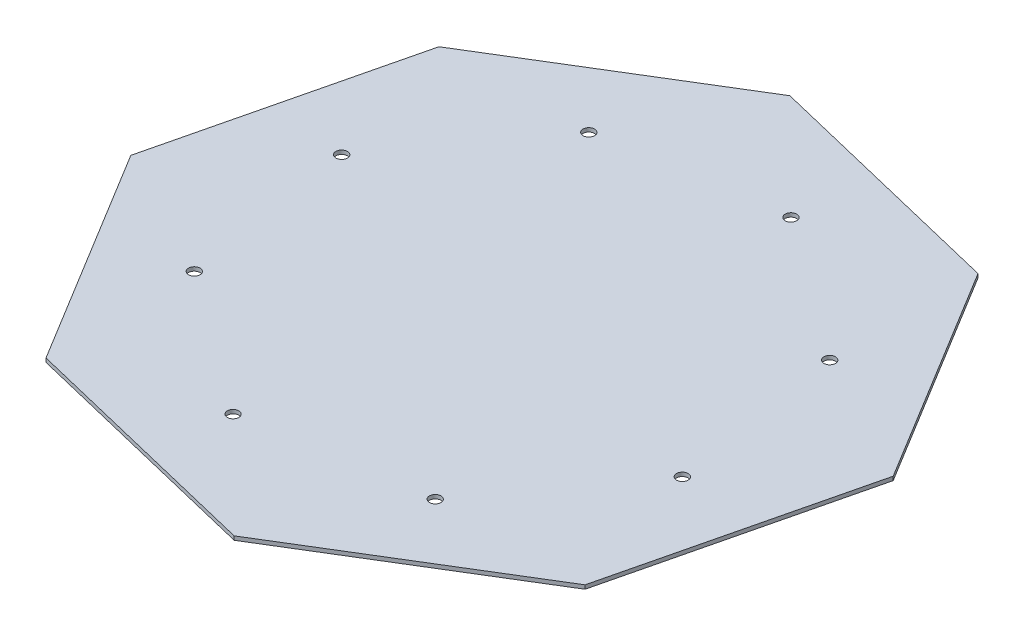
ISO-10303-21;
HEADER;
FILE_DESCRIPTION(('STEP AP214'),'2;1');
FILE_NAME('part.step','',(''),(''),'','','');
FILE_SCHEMA(('AUTOMOTIVE_DESIGN { 1 0 10303 214 1 1 1 1 }'));
ENDSEC;
DATA;
#1=APPLICATION_CONTEXT('core data for automotive mechanical design processes');
#2=APPLICATION_PROTOCOL_DEFINITION('international standard','automotive_design',2000,#1);
#3=PRODUCT_CONTEXT('',#1,'mechanical');
#4=PRODUCT('Part','Part','',(#3));
#5=PRODUCT_RELATED_PRODUCT_CATEGORY('part','',(#4));
#6=PRODUCT_DEFINITION_FORMATION('','',#4);
#7=PRODUCT_DEFINITION_CONTEXT('part definition',#1,'design');
#8=PRODUCT_DEFINITION('design','',#6,#7);
#9=PRODUCT_DEFINITION_SHAPE('','',#8);
#10=(LENGTH_UNIT() NAMED_UNIT(*) SI_UNIT(.MILLI.,.METRE.));
#11=(NAMED_UNIT(*) PLANE_ANGLE_UNIT() SI_UNIT($,.RADIAN.));
#12=(NAMED_UNIT(*) SI_UNIT($,.STERADIAN.) SOLID_ANGLE_UNIT());
#13=UNCERTAINTY_MEASURE_WITH_UNIT(LENGTH_MEASURE(1.E-05),#10,'distance_accuracy_value','');
#14=(GEOMETRIC_REPRESENTATION_CONTEXT(3) GLOBAL_UNCERTAINTY_ASSIGNED_CONTEXT((#13)) GLOBAL_UNIT_ASSIGNED_CONTEXT((#10,
#11,#12)) REPRESENTATION_CONTEXT('',''));
#15=CARTESIAN_POINT('',(0.,0.,0.));
#16=DIRECTION('',(0.,0.,1.));
#17=DIRECTION('',(1.,0.,0.));
#18=AXIS2_PLACEMENT_3D('',#15,#16,#17);
#19=CARTESIAN_POINT('',(0.,1.,0.));
#20=DIRECTION('',(0.,1.,0.));
#21=DIRECTION('',(0.,0.,1.));
#22=AXIS2_PLACEMENT_3D('',#19,#20,#21);
#23=PLANE('',#22);
#24=CARTESIAN_POINT('',(31.2708950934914,1.,51.2067487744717));
#25=DIRECTION('',(0.,1.,0.));
#26=DIRECTION('',(0.,0.,1.));
#27=AXIS2_PLACEMENT_3D('',#24,#25,#26);
#28=CIRCLE('',#27,1.5);
#29=CARTESIAN_POINT('',(31.2708950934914,1.,52.7067487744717));
#30=VERTEX_POINT('',#29);
#31=EDGE_CURVE('E214',#30,#30,#28,.T.);
#32=ORIENTED_EDGE('',*,*,#31,.F.);
#33=EDGE_LOOP('',(#32));
#34=FACE_BOUND('',#33,.T.);
#35=CARTESIAN_POINT('',(-31.2708950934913,1.,-51.2067487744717));
#36=DIRECTION('',(0.,1.,0.));
#37=DIRECTION('',(0.,0.,1.));
#38=AXIS2_PLACEMENT_3D('',#35,#36,#37);
#39=CIRCLE('',#38,1.50000000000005);
#40=CARTESIAN_POINT('',(-31.2708950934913,1.,-49.7067487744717));
#41=VERTEX_POINT('',#40);
#42=EDGE_CURVE('E202',#41,#41,#39,.T.);
#43=ORIENTED_EDGE('',*,*,#42,.F.);
#44=EDGE_LOOP('',(#43));
#45=FACE_BOUND('',#44,.T.);
#46=CARTESIAN_POINT('',(-58.3205012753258,1.,-14.096777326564));
#47=DIRECTION('',(0.,1.,0.));
#48=DIRECTION('',(0.,0.,1.));
#49=AXIS2_PLACEMENT_3D('',#46,#47,#48);
#50=CIRCLE('',#49,1.50000000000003);
#51=CARTESIAN_POINT('',(-58.3205012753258,1.,-12.596777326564));
#52=VERTEX_POINT('',#51);
#53=EDGE_CURVE('E190',#52,#52,#50,.T.);
#54=ORIENTED_EDGE('',*,*,#53,.F.);
#55=EDGE_LOOP('',(#54));
#56=FACE_BOUND('',#55,.T.);
#57=CARTESIAN_POINT('',(-14.096777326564,1.,58.3205012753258));
#58=DIRECTION('',(0.,1.,0.));
#59=DIRECTION('',(0.,0.,1.));
#60=AXIS2_PLACEMENT_3D('',#57,#58,#59);
#61=CIRCLE('',#60,1.50000000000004);
#62=CARTESIAN_POINT('',(-14.096777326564,1.,59.8205012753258));
#63=VERTEX_POINT('',#62);
#64=EDGE_CURVE('E136',#63,#63,#61,.T.);
#65=ORIENTED_EDGE('',*,*,#64,.F.);
#66=EDGE_LOOP('',(#65));
#67=FACE_BOUND('',#66,.T.);
#68=DIRECTION('',(-0.234946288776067,0.,0.972008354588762));
#69=VECTOR('',#68,1.);
#70=CARTESIAN_POINT('',(-69.9752332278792,1.,-51.0052265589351));
#71=LINE('',#70,#69);
#72=CARTESIAN_POINT('',(-69.9752332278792,1.,-51.0052265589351));
#73=VERTEX_POINT('',#72);
#74=CARTESIAN_POINT('',(-85.5461035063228,1.,13.4138203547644));
#75=VERTEX_POINT('',#74);
#76=EDGE_CURVE('E147',#73,#75,#71,.T.);
#77=ORIENTED_EDGE('',*,*,#76,.T.);
#78=DIRECTION('',(0.521181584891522,0.,0.853445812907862));
#79=VECTOR('',#78,1.);
#80=CARTESIAN_POINT('',(-85.5461035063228,1.,13.4138203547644));
#81=LINE('',#80,#79);
#82=CARTESIAN_POINT('',(-51.0052265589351,1.,69.9752332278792));
#83=VERTEX_POINT('',#82);
#84=EDGE_CURVE('E95',#75,#83,#81,.T.);
#85=ORIENTED_EDGE('',*,*,#84,.T.);
#86=DIRECTION('',(0.972008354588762,0.,0.234946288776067));
#87=VECTOR('',#86,1.);
#88=CARTESIAN_POINT('',(-51.0052265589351,1.,69.9752332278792));
#89=LINE('',#88,#87);
#90=CARTESIAN_POINT('',(13.4138203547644,1.,85.5461035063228));
#91=VERTEX_POINT('',#90);
#92=EDGE_CURVE('E162',#83,#91,#89,.T.);
#93=ORIENTED_EDGE('',*,*,#92,.T.);
#94=DIRECTION('',(0.853445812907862,0.,-0.521181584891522));
#95=VECTOR('',#94,1.);
#96=CARTESIAN_POINT('',(13.4138203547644,1.,85.5461035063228));
#97=LINE('',#96,#95);
#98=CARTESIAN_POINT('',(69.9752332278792,1.,51.0052265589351));
#99=VERTEX_POINT('',#98);
#100=EDGE_CURVE('E175',#91,#99,#97,.T.);
#101=ORIENTED_EDGE('',*,*,#100,.T.);
#102=DIRECTION('',(0.234946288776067,0.,-0.972008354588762));
#103=VECTOR('',#102,1.);
#104=CARTESIAN_POINT('',(69.9752332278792,1.,51.0052265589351));
#105=LINE('',#104,#103);
#106=CARTESIAN_POINT('',(85.5461035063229,1.,-13.4138203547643));
#107=VERTEX_POINT('',#106);
#108=EDGE_CURVE('E114',#99,#107,#105,.T.);
#109=ORIENTED_EDGE('',*,*,#108,.T.);
#110=DIRECTION('',(-0.521181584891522,0.,-0.853445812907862));
#111=VECTOR('',#110,1.);
#112=CARTESIAN_POINT('',(85.5461035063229,1.,-13.4138203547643));
#113=LINE('',#112,#111);
#114=CARTESIAN_POINT('',(51.0052265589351,1.,-69.9752332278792));
#115=VERTEX_POINT('',#114);
#116=EDGE_CURVE('E108',#107,#115,#113,.T.);
#117=ORIENTED_EDGE('',*,*,#116,.T.);
#118=DIRECTION('',(-0.972008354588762,0.,-0.234946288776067));
#119=VECTOR('',#118,1.);
#120=CARTESIAN_POINT('',(51.0052265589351,1.,-69.9752332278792));
#121=LINE('',#120,#119);
#122=CARTESIAN_POINT('',(-13.4138203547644,1.,-85.5461035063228));
#123=VERTEX_POINT('',#122);
#124=EDGE_CURVE('E112',#115,#123,#121,.T.);
#125=ORIENTED_EDGE('',*,*,#124,.T.);
#126=DIRECTION('',(-0.853445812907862,0.,0.521181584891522));
#127=VECTOR('',#126,1.);
#128=CARTESIAN_POINT('',(-13.4138203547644,1.,-85.5461035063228));
#129=LINE('',#128,#127);
#130=EDGE_CURVE('E52',#123,#73,#129,.T.);
#131=ORIENTED_EDGE('',*,*,#130,.T.);
#132=EDGE_LOOP('',(#77,#85,#93,#101,#109,#117,#125,#131));
#133=FACE_BOUND('',#132,.T.);
#134=CARTESIAN_POINT('',(14.096777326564,1.,-58.3205012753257));
#135=DIRECTION('',(0.,1.,0.));
#136=DIRECTION('',(0.,0.,1.));
#137=AXIS2_PLACEMENT_3D('',#134,#135,#136);
#138=CIRCLE('',#137,1.50000000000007);
#139=CARTESIAN_POINT('',(14.096777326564,1.,-56.8205012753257));
#140=VERTEX_POINT('',#139);
#141=EDGE_CURVE('E184',#140,#140,#138,.T.);
#142=ORIENTED_EDGE('',*,*,#141,.F.);
#143=EDGE_LOOP('',(#142));
#144=FACE_BOUND('',#143,.T.);
#145=CARTESIAN_POINT('',(58.3205012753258,1.,14.096777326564));
#146=DIRECTION('',(0.,1.,0.));
#147=DIRECTION('',(0.,0.,1.));
#148=AXIS2_PLACEMENT_3D('',#145,#146,#147);
#149=CIRCLE('',#148,1.49999999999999);
#150=CARTESIAN_POINT('',(58.3205012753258,1.,15.596777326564));
#151=VERTEX_POINT('',#150);
#152=EDGE_CURVE('E196',#151,#151,#149,.T.);
#153=ORIENTED_EDGE('',*,*,#152,.F.);
#154=EDGE_LOOP('',(#153));
#155=FACE_BOUND('',#154,.T.);
#156=CARTESIAN_POINT('',(51.2067487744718,1.,-31.2708950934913));
#157=DIRECTION('',(0.,1.,0.));
#158=DIRECTION('',(0.,0.,1.));
#159=AXIS2_PLACEMENT_3D('',#156,#157,#158);
#160=CIRCLE('',#159,1.50000000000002);
#161=CARTESIAN_POINT('',(51.2067487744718,1.,-29.7708950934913));
#162=VERTEX_POINT('',#161);
#163=EDGE_CURVE('E208',#162,#162,#160,.T.);
#164=ORIENTED_EDGE('',*,*,#163,.F.);
#165=EDGE_LOOP('',(#164));
#166=FACE_BOUND('',#165,.T.);
#167=CARTESIAN_POINT('',(-51.2067487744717,1.,31.2708950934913));
#168=DIRECTION('',(0.,1.,0.));
#169=DIRECTION('',(0.,0.,1.));
#170=AXIS2_PLACEMENT_3D('',#167,#168,#169);
#171=CIRCLE('',#170,1.5);
#172=CARTESIAN_POINT('',(-51.2067487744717,1.,32.7708950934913));
#173=VERTEX_POINT('',#172);
#174=EDGE_CURVE('E220',#173,#173,#171,.T.);
#175=ORIENTED_EDGE('',*,*,#174,.F.);
#176=EDGE_LOOP('',(#175));
#177=FACE_BOUND('',#176,.T.);
#178=ADVANCED_FACE('F35',(#34,#45,#56,#67,#133,#144,#155,#166,#177),#23,.T.);
#179=CARTESIAN_POINT('',(0.,0.,0.));
#180=DIRECTION('',(0.,1.,0.));
#181=DIRECTION('',(0.,0.,1.));
#182=AXIS2_PLACEMENT_3D('',#179,#180,#181);
#183=PLANE('',#182);
#184=DIRECTION('',(-0.234946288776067,0.,0.972008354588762));
#185=VECTOR('',#184,1.);
#186=CARTESIAN_POINT('',(-69.9752332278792,0.,-51.0052265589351));
#187=LINE('',#186,#185);
#188=CARTESIAN_POINT('',(-69.9752332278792,0.,-51.0052265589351));
#189=VERTEX_POINT('',#188);
#190=CARTESIAN_POINT('',(-85.5461035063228,0.,13.4138203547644));
#191=VERTEX_POINT('',#190);
#192=EDGE_CURVE('E132',#189,#191,#187,.T.);
#193=ORIENTED_EDGE('',*,*,#192,.F.);
#194=DIRECTION('',(-0.853445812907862,0.,0.521181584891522));
#195=VECTOR('',#194,1.);
#196=CARTESIAN_POINT('',(-13.4138203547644,0.,-85.5461035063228));
#197=LINE('',#196,#195);
#198=CARTESIAN_POINT('',(-13.4138203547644,0.,-85.5461035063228));
#199=VERTEX_POINT('',#198);
#200=EDGE_CURVE('E87',#199,#189,#197,.T.);
#201=ORIENTED_EDGE('',*,*,#200,.F.);
#202=DIRECTION('',(-0.972008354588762,0.,-0.234946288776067));
#203=VECTOR('',#202,1.);
#204=CARTESIAN_POINT('',(51.0052265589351,0.,-69.9752332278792));
#205=LINE('',#204,#203);
#206=CARTESIAN_POINT('',(51.0052265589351,0.,-69.9752332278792));
#207=VERTEX_POINT('',#206);
#208=EDGE_CURVE('E81',#207,#199,#205,.T.);
#209=ORIENTED_EDGE('',*,*,#208,.F.);
#210=DIRECTION('',(-0.521181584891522,0.,-0.853445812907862));
#211=VECTOR('',#210,1.);
#212=CARTESIAN_POINT('',(85.5461035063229,0.,-13.4138203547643));
#213=LINE('',#212,#211);
#214=CARTESIAN_POINT('',(85.5461035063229,0.,-13.4138203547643));
#215=VERTEX_POINT('',#214);
#216=EDGE_CURVE('E122',#215,#207,#213,.T.);
#217=ORIENTED_EDGE('',*,*,#216,.F.);
#218=DIRECTION('',(0.234946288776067,0.,-0.972008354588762));
#219=VECTOR('',#218,1.);
#220=CARTESIAN_POINT('',(69.9752332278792,0.,51.0052265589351));
#221=LINE('',#220,#219);
#222=CARTESIAN_POINT('',(69.9752332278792,0.,51.0052265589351));
#223=VERTEX_POINT('',#222);
#224=EDGE_CURVE('E142',#223,#215,#221,.T.);
#225=ORIENTED_EDGE('',*,*,#224,.F.);
#226=DIRECTION('',(0.853445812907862,0.,-0.521181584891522));
#227=VECTOR('',#226,1.);
#228=CARTESIAN_POINT('',(13.4138203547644,0.,85.5461035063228));
#229=LINE('',#228,#227);
#230=CARTESIAN_POINT('',(13.4138203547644,0.,85.5461035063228));
#231=VERTEX_POINT('',#230);
#232=EDGE_CURVE('E140',#231,#223,#229,.T.);
#233=ORIENTED_EDGE('',*,*,#232,.F.);
#234=DIRECTION('',(0.972008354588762,0.,0.234946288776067));
#235=VECTOR('',#234,1.);
#236=CARTESIAN_POINT('',(-51.0052265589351,0.,69.9752332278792));
#237=LINE('',#236,#235);
#238=CARTESIAN_POINT('',(-51.0052265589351,0.,69.9752332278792));
#239=VERTEX_POINT('',#238);
#240=EDGE_CURVE('E138',#239,#231,#237,.T.);
#241=ORIENTED_EDGE('',*,*,#240,.F.);
#242=DIRECTION('',(0.521181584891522,0.,0.853445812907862));
#243=VECTOR('',#242,1.);
#244=CARTESIAN_POINT('',(-85.5461035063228,0.,13.4138203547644));
#245=LINE('',#244,#243);
#246=EDGE_CURVE('E135',#191,#239,#245,.T.);
#247=ORIENTED_EDGE('',*,*,#246,.F.);
#248=EDGE_LOOP('',(#193,#201,#209,#217,#225,#233,#241,#247));
#249=FACE_BOUND('',#248,.T.);
#250=CARTESIAN_POINT('',(-14.096777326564,0.,58.3205012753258));
#251=DIRECTION('',(0.,1.,0.));
#252=DIRECTION('',(0.,0.,1.));
#253=AXIS2_PLACEMENT_3D('',#250,#251,#252);
#254=CIRCLE('',#253,1.50000000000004);
#255=CARTESIAN_POINT('',(-14.096777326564,0.,59.8205012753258));
#256=VERTEX_POINT('',#255);
#257=EDGE_CURVE('E181',#256,#256,#254,.T.);
#258=ORIENTED_EDGE('',*,*,#257,.T.);
#259=EDGE_LOOP('',(#258));
#260=FACE_BOUND('',#259,.T.);
#261=CARTESIAN_POINT('',(14.096777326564,0.,-58.3205012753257));
#262=DIRECTION('',(0.,1.,0.));
#263=DIRECTION('',(0.,0.,1.));
#264=AXIS2_PLACEMENT_3D('',#261,#262,#263);
#265=CIRCLE('',#264,1.50000000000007);
#266=CARTESIAN_POINT('',(14.096777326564,0.,-56.8205012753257));
#267=VERTEX_POINT('',#266);
#268=EDGE_CURVE('E187',#267,#267,#265,.T.);
#269=ORIENTED_EDGE('',*,*,#268,.T.);
#270=EDGE_LOOP('',(#269));
#271=FACE_BOUND('',#270,.T.);
#272=CARTESIAN_POINT('',(-58.3205012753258,0.,-14.096777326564));
#273=DIRECTION('',(0.,1.,0.));
#274=DIRECTION('',(0.,0.,1.));
#275=AXIS2_PLACEMENT_3D('',#272,#273,#274);
#276=CIRCLE('',#275,1.50000000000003);
#277=CARTESIAN_POINT('',(-58.3205012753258,0.,-12.596777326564));
#278=VERTEX_POINT('',#277);
#279=EDGE_CURVE('E193',#278,#278,#276,.T.);
#280=ORIENTED_EDGE('',*,*,#279,.T.);
#281=EDGE_LOOP('',(#280));
#282=FACE_BOUND('',#281,.T.);
#283=CARTESIAN_POINT('',(58.3205012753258,0.,14.096777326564));
#284=DIRECTION('',(0.,1.,0.));
#285=DIRECTION('',(0.,0.,1.));
#286=AXIS2_PLACEMENT_3D('',#283,#284,#285);
#287=CIRCLE('',#286,1.49999999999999);
#288=CARTESIAN_POINT('',(58.3205012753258,0.,15.596777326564));
#289=VERTEX_POINT('',#288);
#290=EDGE_CURVE('E199',#289,#289,#287,.T.);
#291=ORIENTED_EDGE('',*,*,#290,.T.);
#292=EDGE_LOOP('',(#291));
#293=FACE_BOUND('',#292,.T.);
#294=CARTESIAN_POINT('',(-31.2708950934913,0.,-51.2067487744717));
#295=DIRECTION('',(0.,1.,0.));
#296=DIRECTION('',(0.,0.,1.));
#297=AXIS2_PLACEMENT_3D('',#294,#295,#296);
#298=CIRCLE('',#297,1.50000000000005);
#299=CARTESIAN_POINT('',(-31.2708950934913,0.,-49.7067487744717));
#300=VERTEX_POINT('',#299);
#301=EDGE_CURVE('E205',#300,#300,#298,.T.);
#302=ORIENTED_EDGE('',*,*,#301,.T.);
#303=EDGE_LOOP('',(#302));
#304=FACE_BOUND('',#303,.T.);
#305=CARTESIAN_POINT('',(51.2067487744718,0.,-31.2708950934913));
#306=DIRECTION('',(0.,1.,0.));
#307=DIRECTION('',(0.,0.,1.));
#308=AXIS2_PLACEMENT_3D('',#305,#306,#307);
#309=CIRCLE('',#308,1.50000000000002);
#310=CARTESIAN_POINT('',(51.2067487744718,0.,-29.7708950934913));
#311=VERTEX_POINT('',#310);
#312=EDGE_CURVE('E211',#311,#311,#309,.T.);
#313=ORIENTED_EDGE('',*,*,#312,.T.);
#314=EDGE_LOOP('',(#313));
#315=FACE_BOUND('',#314,.T.);
#316=CARTESIAN_POINT('',(31.2708950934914,0.,51.2067487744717));
#317=DIRECTION('',(0.,1.,0.));
#318=DIRECTION('',(0.,0.,1.));
#319=AXIS2_PLACEMENT_3D('',#316,#317,#318);
#320=CIRCLE('',#319,1.5);
#321=CARTESIAN_POINT('',(31.2708950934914,0.,52.7067487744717));
#322=VERTEX_POINT('',#321);
#323=EDGE_CURVE('E217',#322,#322,#320,.T.);
#324=ORIENTED_EDGE('',*,*,#323,.T.);
#325=EDGE_LOOP('',(#324));
#326=FACE_BOUND('',#325,.T.);
#327=CARTESIAN_POINT('',(-51.2067487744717,0.,31.2708950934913));
#328=DIRECTION('',(0.,1.,0.));
#329=DIRECTION('',(0.,0.,1.));
#330=AXIS2_PLACEMENT_3D('',#327,#328,#329);
#331=CIRCLE('',#330,1.5);
#332=CARTESIAN_POINT('',(-51.2067487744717,0.,32.7708950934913));
#333=VERTEX_POINT('',#332);
#334=EDGE_CURVE('E223',#333,#333,#331,.T.);
#335=ORIENTED_EDGE('',*,*,#334,.T.);
#336=EDGE_LOOP('',(#335));
#337=FACE_BOUND('',#336,.T.);
#338=ADVANCED_FACE('F166',(#249,#260,#271,#282,#293,#304,#315,#326,#337),#183,.F.);
#339=CARTESIAN_POINT('',(-69.9752332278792,1.,-51.0052265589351));
#340=DIRECTION('',(0.972008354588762,0.,0.234946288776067));
#341=DIRECTION('',(0.234946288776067,0.,-0.972008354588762));
#342=AXIS2_PLACEMENT_3D('',#339,#340,#341);
#343=PLANE('',#342);
#344=ORIENTED_EDGE('',*,*,#192,.T.);
#345=DIRECTION('',(0.,-1.,0.));
#346=VECTOR('',#345,1.);
#347=CARTESIAN_POINT('',(-85.5461035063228,1.,13.4138203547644));
#348=LINE('',#347,#346);
#349=EDGE_CURVE('E11',#75,#191,#348,.T.);
#350=ORIENTED_EDGE('',*,*,#349,.F.);
#351=ORIENTED_EDGE('',*,*,#76,.F.);
#352=DIRECTION('',(0.,-1.,0.));
#353=VECTOR('',#352,1.);
#354=CARTESIAN_POINT('',(-69.9752332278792,1.,-51.0052265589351));
#355=LINE('',#354,#353);
#356=EDGE_CURVE('E128',#73,#189,#355,.T.);
#357=ORIENTED_EDGE('',*,*,#356,.T.);
#358=EDGE_LOOP('',(#344,#350,#351,#357));
#359=FACE_BOUND('',#358,.T.);
#360=ADVANCED_FACE('F37',(#359),#343,.F.);
#361=CARTESIAN_POINT('',(-85.5461035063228,1.,13.4138203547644));
#362=DIRECTION('',(0.853445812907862,0.,-0.521181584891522));
#363=DIRECTION('',(-0.521181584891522,0.,-0.853445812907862));
#364=AXIS2_PLACEMENT_3D('',#361,#362,#363);
#365=PLANE('',#364);
#366=ORIENTED_EDGE('',*,*,#246,.T.);
#367=DIRECTION('',(0.,-1.,0.));
#368=VECTOR('',#367,1.);
#369=CARTESIAN_POINT('',(-51.0052265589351,1.,69.9752332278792));
#370=LINE('',#369,#368);
#371=EDGE_CURVE('E44',#83,#239,#370,.T.);
#372=ORIENTED_EDGE('',*,*,#371,.F.);
#373=ORIENTED_EDGE('',*,*,#84,.F.);
#374=ORIENTED_EDGE('',*,*,#349,.T.);
#375=EDGE_LOOP('',(#366,#372,#373,#374));
#376=FACE_BOUND('',#375,.T.);
#377=ADVANCED_FACE('F257',(#376),#365,.F.);
#378=CARTESIAN_POINT('',(-51.0052265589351,1.,69.9752332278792));
#379=DIRECTION('',(0.234946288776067,0.,-0.972008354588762));
#380=DIRECTION('',(-0.972008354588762,0.,-0.234946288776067));
#381=AXIS2_PLACEMENT_3D('',#378,#379,#380);
#382=PLANE('',#381);
#383=ORIENTED_EDGE('',*,*,#240,.T.);
#384=DIRECTION('',(0.,-1.,0.));
#385=VECTOR('',#384,1.);
#386=CARTESIAN_POINT('',(13.4138203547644,1.,85.5461035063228));
#387=LINE('',#386,#385);
#388=EDGE_CURVE('E154',#91,#231,#387,.T.);
#389=ORIENTED_EDGE('',*,*,#388,.F.);
#390=ORIENTED_EDGE('',*,*,#92,.F.);
#391=ORIENTED_EDGE('',*,*,#371,.T.);
#392=EDGE_LOOP('',(#383,#389,#390,#391));
#393=FACE_BOUND('',#392,.T.);
#394=ADVANCED_FACE('F160',(#393),#382,.F.);
#395=CARTESIAN_POINT('',(13.4138203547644,1.,85.5461035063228));
#396=DIRECTION('',(-0.521181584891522,0.,-0.853445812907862));
#397=DIRECTION('',(-0.853445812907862,0.,0.521181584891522));
#398=AXIS2_PLACEMENT_3D('',#395,#396,#397);
#399=PLANE('',#398);
#400=ORIENTED_EDGE('',*,*,#232,.T.);
#401=DIRECTION('',(0.,-1.,0.));
#402=VECTOR('',#401,1.);
#403=CARTESIAN_POINT('',(69.9752332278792,1.,51.0052265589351));
#404=LINE('',#403,#402);
#405=EDGE_CURVE('E151',#99,#223,#404,.T.);
#406=ORIENTED_EDGE('',*,*,#405,.F.);
#407=ORIENTED_EDGE('',*,*,#100,.F.);
#408=ORIENTED_EDGE('',*,*,#388,.T.);
#409=EDGE_LOOP('',(#400,#406,#407,#408));
#410=FACE_BOUND('',#409,.T.);
#411=ADVANCED_FACE('F171',(#410),#399,.F.);
#412=CARTESIAN_POINT('',(69.9752332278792,1.,51.0052265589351));
#413=DIRECTION('',(-0.972008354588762,0.,-0.234946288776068));
#414=DIRECTION('',(-0.234946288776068,0.,0.972008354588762));
#415=AXIS2_PLACEMENT_3D('',#412,#413,#414);
#416=PLANE('',#415);
#417=ORIENTED_EDGE('',*,*,#224,.T.);
#418=DIRECTION('',(0.,-1.,0.));
#419=VECTOR('',#418,1.);
#420=CARTESIAN_POINT('',(85.5461035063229,1.,-13.4138203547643));
#421=LINE('',#420,#419);
#422=EDGE_CURVE('E123',#107,#215,#421,.T.);
#423=ORIENTED_EDGE('',*,*,#422,.F.);
#424=ORIENTED_EDGE('',*,*,#108,.F.);
#425=ORIENTED_EDGE('',*,*,#405,.T.);
#426=EDGE_LOOP('',(#417,#423,#424,#425));
#427=FACE_BOUND('',#426,.T.);
#428=ADVANCED_FACE('F174',(#427),#416,.F.);
#429=CARTESIAN_POINT('',(85.5461035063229,1.,-13.4138203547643));
#430=DIRECTION('',(-0.853445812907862,0.,0.521181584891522));
#431=DIRECTION('',(0.521181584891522,0.,0.853445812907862));
#432=AXIS2_PLACEMENT_3D('',#429,#430,#431);
#433=PLANE('',#432);
#434=ORIENTED_EDGE('',*,*,#216,.T.);
#435=DIRECTION('',(0.,-1.,0.));
#436=VECTOR('',#435,1.);
#437=CARTESIAN_POINT('',(51.0052265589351,1.,-69.9752332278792));
#438=LINE('',#437,#436);
#439=EDGE_CURVE('E119',#115,#207,#438,.T.);
#440=ORIENTED_EDGE('',*,*,#439,.F.);
#441=ORIENTED_EDGE('',*,*,#116,.F.);
#442=ORIENTED_EDGE('',*,*,#422,.T.);
#443=EDGE_LOOP('',(#434,#440,#441,#442));
#444=FACE_BOUND('',#443,.T.);
#445=ADVANCED_FACE('F120',(#444),#433,.F.);
#446=CARTESIAN_POINT('',(51.0052265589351,1.,-69.9752332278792));
#447=DIRECTION('',(-0.234946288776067,0.,0.972008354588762));
#448=DIRECTION('',(0.972008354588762,0.,0.234946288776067));
#449=AXIS2_PLACEMENT_3D('',#446,#447,#448);
#450=PLANE('',#449);
#451=ORIENTED_EDGE('',*,*,#208,.T.);
#452=DIRECTION('',(0.,-1.,0.));
#453=VECTOR('',#452,1.);
#454=CARTESIAN_POINT('',(-13.4138203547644,1.,-85.5461035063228));
#455=LINE('',#454,#453);
#456=EDGE_CURVE('E124',#123,#199,#455,.T.);
#457=ORIENTED_EDGE('',*,*,#456,.F.);
#458=ORIENTED_EDGE('',*,*,#124,.F.);
#459=ORIENTED_EDGE('',*,*,#439,.T.);
#460=EDGE_LOOP('',(#451,#457,#458,#459));
#461=FACE_BOUND('',#460,.T.);
#462=ADVANCED_FACE('F126',(#461),#450,.F.);
#463=CARTESIAN_POINT('',(-13.4138203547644,1.,-85.5461035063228));
#464=DIRECTION('',(0.521181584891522,0.,0.853445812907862));
#465=DIRECTION('',(0.853445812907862,0.,-0.521181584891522));
#466=AXIS2_PLACEMENT_3D('',#463,#464,#465);
#467=PLANE('',#466);
#468=ORIENTED_EDGE('',*,*,#200,.T.);
#469=ORIENTED_EDGE('',*,*,#356,.F.);
#470=ORIENTED_EDGE('',*,*,#130,.F.);
#471=ORIENTED_EDGE('',*,*,#456,.T.);
#472=EDGE_LOOP('',(#468,#469,#470,#471));
#473=FACE_BOUND('',#472,.T.);
#474=ADVANCED_FACE('F245',(#473),#467,.F.);
#475=CARTESIAN_POINT('',(-14.096777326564,1.,58.3205012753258));
#476=DIRECTION('',(0.,-1.,0.));
#477=DIRECTION('',(0.,0.,-1.));
#478=AXIS2_PLACEMENT_3D('',#475,#476,#477);
#479=CYLINDRICAL_SURFACE('',#478,1.50000000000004);
#480=ORIENTED_EDGE('',*,*,#64,.T.);
#481=EDGE_LOOP('',(#480));
#482=FACE_BOUND('',#481,.T.);
#483=ORIENTED_EDGE('',*,*,#257,.F.);
#484=EDGE_LOOP('',(#483));
#485=FACE_BOUND('',#484,.T.);
#486=ADVANCED_FACE('F242',(#482,#485),#479,.F.);
#487=CARTESIAN_POINT('',(14.096777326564,1.,-58.3205012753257));
#488=DIRECTION('',(0.,-1.,0.));
#489=DIRECTION('',(0.,0.,-1.));
#490=AXIS2_PLACEMENT_3D('',#487,#488,#489);
#491=CYLINDRICAL_SURFACE('',#490,1.50000000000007);
#492=ORIENTED_EDGE('',*,*,#141,.T.);
#493=EDGE_LOOP('',(#492));
#494=FACE_BOUND('',#493,.T.);
#495=ORIENTED_EDGE('',*,*,#268,.F.);
#496=EDGE_LOOP('',(#495));
#497=FACE_BOUND('',#496,.T.);
#498=ADVANCED_FACE('F323',(#494,#497),#491,.F.);
#499=CARTESIAN_POINT('',(-58.3205012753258,1.,-14.096777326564));
#500=DIRECTION('',(0.,-1.,0.));
#501=DIRECTION('',(0.,0.,-1.));
#502=AXIS2_PLACEMENT_3D('',#499,#500,#501);
#503=CYLINDRICAL_SURFACE('',#502,1.50000000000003);
#504=ORIENTED_EDGE('',*,*,#53,.T.);
#505=EDGE_LOOP('',(#504));
#506=FACE_BOUND('',#505,.T.);
#507=ORIENTED_EDGE('',*,*,#279,.F.);
#508=EDGE_LOOP('',(#507));
#509=FACE_BOUND('',#508,.T.);
#510=ADVANCED_FACE('F331',(#506,#509),#503,.F.);
#511=CARTESIAN_POINT('',(58.3205012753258,1.,14.096777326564));
#512=DIRECTION('',(0.,-1.,0.));
#513=DIRECTION('',(0.,0.,-1.));
#514=AXIS2_PLACEMENT_3D('',#511,#512,#513);
#515=CYLINDRICAL_SURFACE('',#514,1.49999999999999);
#516=ORIENTED_EDGE('',*,*,#152,.T.);
#517=EDGE_LOOP('',(#516));
#518=FACE_BOUND('',#517,.T.);
#519=ORIENTED_EDGE('',*,*,#290,.F.);
#520=EDGE_LOOP('',(#519));
#521=FACE_BOUND('',#520,.T.);
#522=ADVANCED_FACE('F339',(#518,#521),#515,.F.);
#523=CARTESIAN_POINT('',(-31.2708950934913,1.,-51.2067487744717));
#524=DIRECTION('',(0.,-1.,0.));
#525=DIRECTION('',(0.,0.,-1.));
#526=AXIS2_PLACEMENT_3D('',#523,#524,#525);
#527=CYLINDRICAL_SURFACE('',#526,1.50000000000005);
#528=ORIENTED_EDGE('',*,*,#42,.T.);
#529=EDGE_LOOP('',(#528));
#530=FACE_BOUND('',#529,.T.);
#531=ORIENTED_EDGE('',*,*,#301,.F.);
#532=EDGE_LOOP('',(#531));
#533=FACE_BOUND('',#532,.T.);
#534=ADVANCED_FACE('F348',(#530,#533),#527,.F.);
#535=CARTESIAN_POINT('',(51.2067487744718,1.,-31.2708950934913));
#536=DIRECTION('',(0.,-1.,0.));
#537=DIRECTION('',(0.,0.,-1.));
#538=AXIS2_PLACEMENT_3D('',#535,#536,#537);
#539=CYLINDRICAL_SURFACE('',#538,1.50000000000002);
#540=ORIENTED_EDGE('',*,*,#163,.T.);
#541=EDGE_LOOP('',(#540));
#542=FACE_BOUND('',#541,.T.);
#543=ORIENTED_EDGE('',*,*,#312,.F.);
#544=EDGE_LOOP('',(#543));
#545=FACE_BOUND('',#544,.T.);
#546=ADVANCED_FACE('F357',(#542,#545),#539,.F.);
#547=CARTESIAN_POINT('',(31.2708950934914,1.,51.2067487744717));
#548=DIRECTION('',(0.,-1.,0.));
#549=DIRECTION('',(0.,0.,-1.));
#550=AXIS2_PLACEMENT_3D('',#547,#548,#549);
#551=CYLINDRICAL_SURFACE('',#550,1.5);
#552=ORIENTED_EDGE('',*,*,#31,.T.);
#553=EDGE_LOOP('',(#552));
#554=FACE_BOUND('',#553,.T.);
#555=ORIENTED_EDGE('',*,*,#323,.F.);
#556=EDGE_LOOP('',(#555));
#557=FACE_BOUND('',#556,.T.);
#558=ADVANCED_FACE('F366',(#554,#557),#551,.F.);
#559=CARTESIAN_POINT('',(-51.2067487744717,1.,31.2708950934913));
#560=DIRECTION('',(0.,-1.,0.));
#561=DIRECTION('',(0.,0.,-1.));
#562=AXIS2_PLACEMENT_3D('',#559,#560,#561);
#563=CYLINDRICAL_SURFACE('',#562,1.5);
#564=ORIENTED_EDGE('',*,*,#174,.T.);
#565=EDGE_LOOP('',(#564));
#566=FACE_BOUND('',#565,.T.);
#567=ORIENTED_EDGE('',*,*,#334,.F.);
#568=EDGE_LOOP('',(#567));
#569=FACE_BOUND('',#568,.T.);
#570=ADVANCED_FACE('F229',(#566,#569),#563,.F.);
#571=CLOSED_SHELL('',(#178,#338,#360,#377,#394,#411,#428,#445,#462,#474,#486,#498,#510,#522,
#534,#546,#558,#570));
#572=MANIFOLD_SOLID_BREP('B2',#571);
#573=ADVANCED_BREP_SHAPE_REPRESENTATION('',(#18,#572),#14);
#574=SHAPE_DEFINITION_REPRESENTATION(#9,#573);
ENDSEC;
END-ISO-10303-21;
